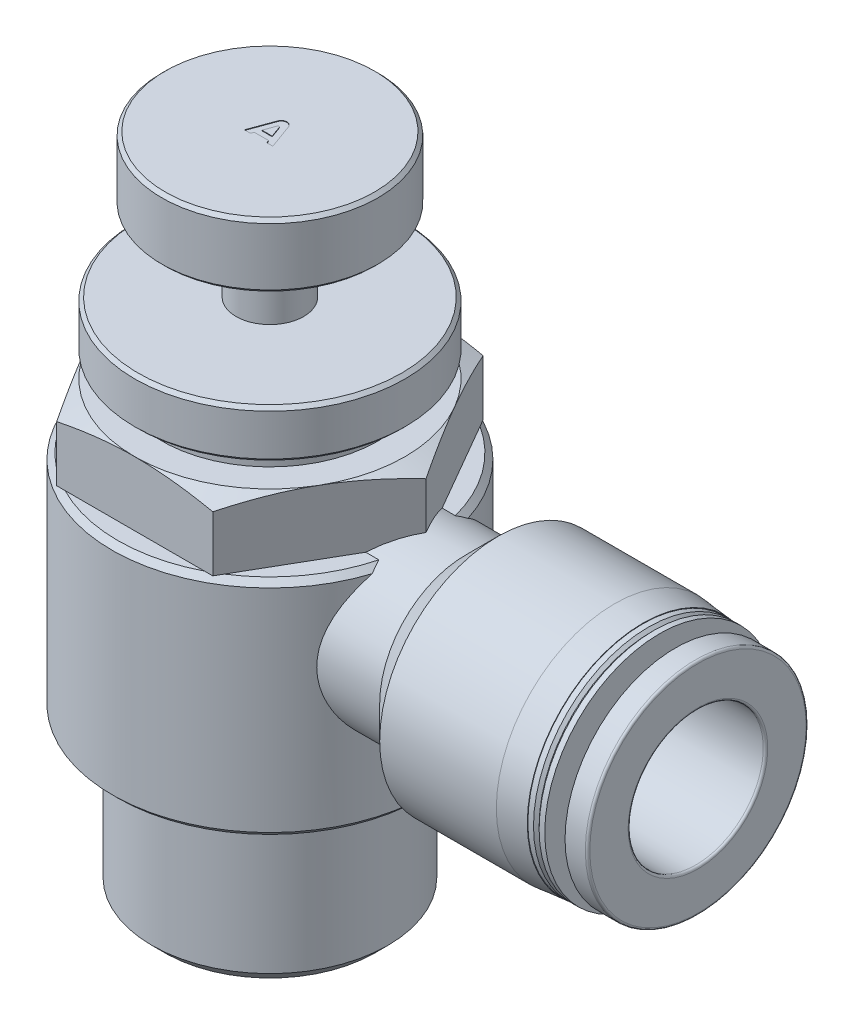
from build123d import *

# Parameters (mm, degrees)
SKETCH_2_R          = 24
CUT_EXTRUDE_1_DEPTH = 5.7
CUT_EXTRUDE_2_DEPTH = 0.05


with BuildPart() as part:
    # Sketch 1 → Revolve 1 (revolve)
    with BuildSketch(Plane.XY, mode=Mode.PRIVATE) as revolve_1_sk:
        Polygon((0, -27), (-9.3155, -27), (-10.4775, -25.838), (-10.4775, -13), (-13.5, -13), (-14, -12.5), (-14, 6.3), (-13.5, 6.8), (-13.856406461, 6.8), (-13.856406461, 11.731051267), (-12, 12.5), (-9.6, 12.5), (-9.6, 13.7), (-9.3, 14), (-3, 14), (-3, 14.5), (-11.7, 14.5), (-12, 14.8), (-12, 18.475), (-11.7, 18.775), (-3, 18.775), (-3, 25.4935), (-2.6935, 25.8), (-9.3, 25.8), (-9.6, 26.1), (-9.6, 31.2), (-9.3, 31.5), (0, 31.5), align=None)
    revolve(revolve_1_sk.sketch.rotate(Axis((0, 31.5, 0), (0, -1, 0)), 180), axis=Axis((0, 31.5, 0), (0, -1, 0)))

    # Sketch 2 → Cut-Extrude 1 (cut)
    with BuildSketch(Plane(origin=(0, 6.8, 0), x_dir=(1, 0, 0), z_dir=(0, 1, 0))):
        Circle(SKETCH_2_R)
        Polygon((-13.856406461, 0), (-6.92820323, -12), (6.92820323, -12), (13.856406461, 0), (6.92820323, 12), (-6.92820323, 12), align=None, mode=Mode.SUBTRACT)
    extrude(amount=CUT_EXTRUDE_1_DEPTH, mode=Mode.SUBTRACT)

    # Sketch 3 → Revolve 2 (revolve)
    with BuildSketch(Plane.XY, mode=Mode.PRIVATE) as revolve_2_sk:
        with BuildLine():
            Line((0, 4), (15, 4))
            Line((15, 4), (15, 6))
            Line((15, 6), (37.8, 6))
            ThreePointArc((37.8, 6), (37.941421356, 6.058578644), (38, 6.2))
            Line((38, 6.2), (38, 9.6))
            ThreePointArc((38, 9.6), (37.941421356, 9.741421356), (37.8, 9.8))
            Line((37.8, 9.8), (36, 9.8))
            Line((36, 9.8), (36, 6.9))
            Line((36, 6.9), (34.6, 6.9))
            Line((34.6, 6.9), (34.6, 10.2))
            Line((34.6, 10.2), (34.1, 10.2))
            Line((34.1, 10.2), (33.85, 9.95))
            Line((33.85, 9.95), (33.6, 10.2))
            Line((33.6, 10.2), (33.1, 10.2))
            Line((33.1, 10.2), (33.1, 10.25))
            Line((33.1, 10.25), (30.6, 10.5))
            Line((30.6, 10.5), (20.246406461, 10.5))
            Line((20.246406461, 10.5), (17.346406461, 7.6))
            Line((17.346406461, 7.6), (0, 7.6))
            Line((0, 7.6), (0, 4))
        make_face()
    revolve(revolve_2_sk.sketch.rotate(Axis((38, 0, 0), (-1, 0, 0)), 270), axis=Axis((38, 0, 0), (-1, 0, 0)))

    # Sketch 4 → Cut-Revolve 1 (revolve, cut)
    with BuildSketch(Plane.XY, mode=Mode.PRIVATE) as cut_revolve_1_sk:
        with BuildLine():
            Line((0, -27), (-5.53875, -27))
            ThreePointArc((-5.53875, -27), (-5.326617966, -26.912132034), (-5.23875, -26.7))
            Line((-5.23875, -26.7), (-5.23875, 0))
            Line((-5.23875, 0), (-3.4925, 0))
            Line((-3.4925, 0), (-3.4925, 3.4925))
            ThreePointArc((-3.4925, 3.4925), (-2.469570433, 5.962070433), (0, 6.985))
            Line((0, 6.985), (0, -27))
        make_face()
    revolve(cut_revolve_1_sk.sketch.rotate(Axis((0, 6.985, 0), (0, -1, 0)), 90), axis=Axis((0, 6.985, 0), (0, -1, 0)), mode=Mode.SUBTRACT)

    # Sketch 5 → Cut-Revolve 2 (revolve, cut)
    with BuildSketch(Plane.XY, mode=Mode.PRIVATE) as cut_revolve_2_sk:
        Polygon((0, 0), (0, 4), (15, 4), (15, 6), (38, 6), (38, 0), align=None)
    revolve(cut_revolve_2_sk.sketch.rotate(Axis((38, 0, 0), (-1, 0, 0)), 270), axis=Axis((38, 0, 0), (-1, 0, 0)), mode=Mode.SUBTRACT)

    # Sketch 6 → Cut-Extrude 2 (cut)
    with BuildSketch(Plane(origin=(0, 31.5, 0), x_dir=(1, 0, 0), z_dir=(0, 1, 0))):
        with BuildLine():
            Line((-1.260029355, -1), (-0.727940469, -1))
            Line((-0.727940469, -1), (-0.63694791, -0.75))
            Line((-0.63694791, -0.75), (0.63694791, -0.75))
            Line((0.63694791, -0.75), (0.727940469, -1))
            Line((0.727940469, -1), (1.260029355, -1))
            Line((1.260029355, -1), (0.46984631, 1.171010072))
            ThreePointArc((0.46984631, 1.171010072), (0, 1.5), (-0.46984631, 1.171010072))
            Line((-0.46984631, 1.171010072), (-1.260029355, -1))
        make_face()
        with BuildLine():
            Line((-0.454962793, -0.25), (0.454962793, -0.25))
            Line((0.454962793, -0.25), (0.093969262, 0.741821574))
            ThreePointArc((0.093969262, 0.741821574), (0, 0.80761956), (-0.093969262, 0.741821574))
            Line((-0.093969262, 0.741821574), (-0.454962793, -0.25))
        make_face(mode=Mode.SUBTRACT)
    extrude(amount=-CUT_EXTRUDE_2_DEPTH, mode=Mode.SUBTRACT)


solid = part.part
